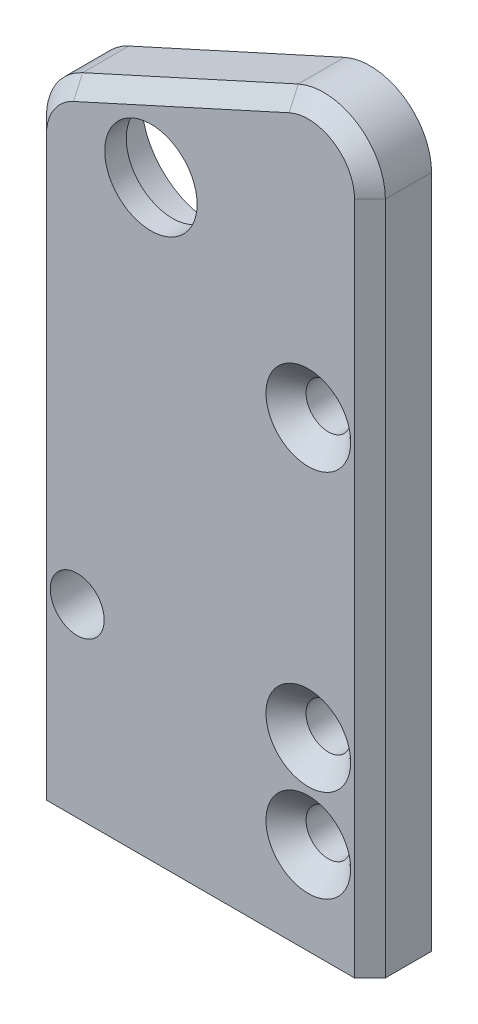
from build123d import *

# Parameters (mm, degrees)
RESSALTO_EXTRUS_O1_DEPTH                             = 4
FILETE1_R                                            = 4
CHANFRO1_SIZE                                        = 1
FURO_DE_DI_METRO_6_0_6_1_D                           = 6
ESCAREADO_PARA_PARAFUSO_COM_CABE_A_ESCAR_D           = 2.9
ESCAREADO_PARA_PARAFUSO_COM_CABE_A_ESCAR_CSINK_D     = 5.5
ESCAREADO_PARA_PARAFUSO_COM_CABE_A_ESCAR_CSINK_ANGLE = 90
BROCA_DE_ROSQUEAR_PARA_TARRAXA_DE_M21_D              = 1.6
BROCA_DE_ROSQUEAR_PARA_TARRAXA_DE_M21_DEPTH          = 10
BROCA_DE_ROSQUEAR_PARA_TARRAXA_DE_M21_TIP            = 0.480688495
ESCAREADO_PARA_PARAFUSO_COM_CABE_A_E_2_D             = 2.9
ESCAREADO_PARA_PARAFUSO_COM_CABE_A_E_2_DEPTH         = 4
ESCAREADO_PARA_PARAFUSO_COM_CABE_A_E_2_CSINK_D       = 5.5
ESCAREADO_PARA_PARAFUSO_COM_CABE_A_E_2_CSINK_ANGLE   = 90
ESCAREADO_PARA_PARAFUSO_COM_CABE_A_E_2_TIP           = 0.871247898
ESBO_O10_R                                           = 4.6
CORTE_EXTRUS_O1_DEPTH                                = 2.6
FURO_DE_DI_METRO_3_5_3_5_1_D                         = 3.5


with BuildPart() as part:
    # Esbo_o1 → Ressalto-extrus_o1 (new body)
    with BuildSketch(Plane.XY):
        Polygon((0, 0), (22, 0), (22, 50), (0, 40), align=None)
    extrude(amount=RESSALTO_EXTRUS_O1_DEPTH)

    # Filete1
    filete1_edges = [part.edges().sort_by_distance(p)[0] for p in [
        (0, 40, 2),
        (22, 50, 2),
    ]]
    fillet(filete1_edges, radius=FILETE1_R)

    # Chanfro1
    chanfro1_edges = [part.edges().sort_by_distance(p)[0] for p in [
        (22, 21.893991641, 4),
        (0, 18.712173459, 4),
        (9.344788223, 44.24763101, 4),
        (20.165542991, 47.151080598, 4),
        (0.636902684, 39.58988991, 4),
    ]]
    chamfer(chanfro1_edges, length=CHANFRO1_SIZE)

    # Furo de di_metro _6.0 _6_1 (through all)
    with Locations(Plane(origin=(7.780869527, 38.393713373, 4), x_dir=(1, 0, 0), z_dir=(0, 0, 1))):
        with Locations((0, 0)):
            Hole(FURO_DE_DI_METRO_6_0_6_1_D / 2)

    # Escareado para parafuso com cabe_a escar (through all)
    with Locations(Plane(origin=(18, 6, 4), x_dir=(1, 0, 0), z_dir=(0, 0, 1))):
        with Locations((0, 0), (0, 6)):
            CounterSinkHole(ESCAREADO_PARA_PARAFUSO_COM_CABE_A_ESCAR_D / 2, ESCAREADO_PARA_PARAFUSO_COM_CABE_A_ESCAR_CSINK_D / 2, counter_sink_angle=ESCAREADO_PARA_PARAFUSO_COM_CABE_A_ESCAR_CSINK_ANGLE)

    # Broca de rosquear para tarraxa de M21
    with Locations(Plane(origin=(4, 0, 2), x_dir=(0, 0, -1), z_dir=(0, -1, 0))):
        with Locations((0, 0), (0, 8)):
            Hole(BROCA_DE_ROSQUEAR_PARA_TARRAXA_DE_M21_D / 2, depth=BROCA_DE_ROSQUEAR_PARA_TARRAXA_DE_M21_DEPTH)
            with Locations((0, 0, -(BROCA_DE_ROSQUEAR_PARA_TARRAXA_DE_M21_DEPTH + BROCA_DE_ROSQUEAR_PARA_TARRAXA_DE_M21_TIP / 2))):  # 118° drill point
                Cone(0, BROCA_DE_ROSQUEAR_PARA_TARRAXA_DE_M21_D / 2, BROCA_DE_ROSQUEAR_PARA_TARRAXA_DE_M21_TIP, mode=Mode.SUBTRACT)

    # Escareado para parafuso com cabe_a e 2
    with Locations(Plane(origin=(18, 30, 4), x_dir=(1, 0, 0), z_dir=(0, 0, 1))):
        with Locations((0, 0)):
            CounterSinkHole(ESCAREADO_PARA_PARAFUSO_COM_CABE_A_E_2_D / 2, ESCAREADO_PARA_PARAFUSO_COM_CABE_A_E_2_CSINK_D / 2, depth=ESCAREADO_PARA_PARAFUSO_COM_CABE_A_E_2_DEPTH, counter_sink_angle=ESCAREADO_PARA_PARAFUSO_COM_CABE_A_E_2_CSINK_ANGLE)
            with Locations((0, 0, -(ESCAREADO_PARA_PARAFUSO_COM_CABE_A_E_2_DEPTH + ESCAREADO_PARA_PARAFUSO_COM_CABE_A_E_2_TIP / 2))):  # 118° drill point
                Cone(0, ESCAREADO_PARA_PARAFUSO_COM_CABE_A_E_2_D / 2, ESCAREADO_PARA_PARAFUSO_COM_CABE_A_E_2_TIP, mode=Mode.SUBTRACT)

    # Esbo_o10 → Corte-extrus_o1 (cut)
    with BuildSketch(Plane(origin=(0, 0, 0), x_dir=(-1, 0, 0), z_dir=(0, 0, -1))):
        with Locations((-7.780869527, 38.393713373)):
            Circle(ESBO_O10_R)
    extrude(amount=-CORTE_EXTRUS_O1_DEPTH, mode=Mode.SUBTRACT)

    # Furo de di_metro _3.5 _3.5_1 (through all)
    with Locations(Plane(origin=(3, 12, 4), x_dir=(1, 0, 0), z_dir=(0, 0, 1))):
        with Locations((0, 0)):
            Hole(FURO_DE_DI_METRO_3_5_3_5_1_D / 2)


solid = part.part
